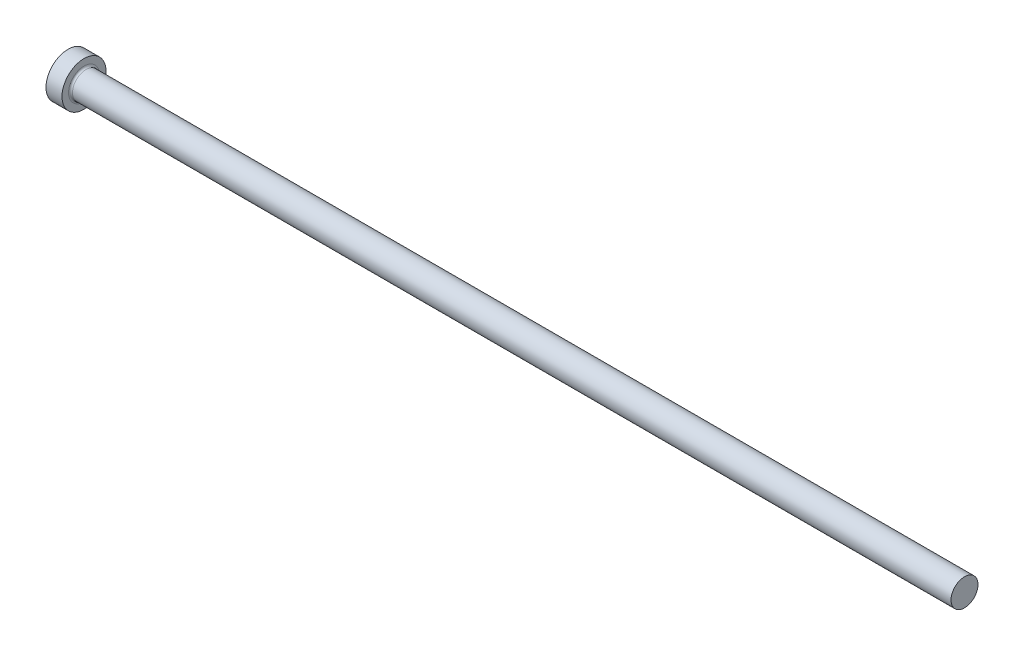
ISO-10303-21;
HEADER;
FILE_DESCRIPTION(('STEP AP214'),'2;1');
FILE_NAME('part.step','',(''),(''),'','','');
FILE_SCHEMA(('AUTOMOTIVE_DESIGN { 1 0 10303 214 1 1 1 1 }'));
ENDSEC;
DATA;
#1=APPLICATION_CONTEXT('core data for automotive mechanical design processes');
#2=APPLICATION_PROTOCOL_DEFINITION('international standard','automotive_design',2000,#1);
#3=PRODUCT_CONTEXT('',#1,'mechanical');
#4=PRODUCT('Part','Part','',(#3));
#5=PRODUCT_RELATED_PRODUCT_CATEGORY('part','',(#4));
#6=PRODUCT_DEFINITION_FORMATION('','',#4);
#7=PRODUCT_DEFINITION_CONTEXT('part definition',#1,'design');
#8=PRODUCT_DEFINITION('design','',#6,#7);
#9=PRODUCT_DEFINITION_SHAPE('','',#8);
#10=(LENGTH_UNIT() NAMED_UNIT(*) SI_UNIT(.MILLI.,.METRE.));
#11=(NAMED_UNIT(*) PLANE_ANGLE_UNIT() SI_UNIT($,.RADIAN.));
#12=(NAMED_UNIT(*) SI_UNIT($,.STERADIAN.) SOLID_ANGLE_UNIT());
#13=UNCERTAINTY_MEASURE_WITH_UNIT(LENGTH_MEASURE(1.E-05),#10,'distance_accuracy_value','');
#14=(GEOMETRIC_REPRESENTATION_CONTEXT(3) GLOBAL_UNCERTAINTY_ASSIGNED_CONTEXT((#13)) GLOBAL_UNIT_ASSIGNED_CONTEXT((#10,
#11,#12)) REPRESENTATION_CONTEXT('',''));
#15=CARTESIAN_POINT('',(0.,0.,0.));
#16=DIRECTION('',(0.,0.,1.));
#17=DIRECTION('',(1.,0.,0.));
#18=AXIS2_PLACEMENT_3D('',#15,#16,#17);
#19=CARTESIAN_POINT('',(0.,0.,0.));
#20=DIRECTION('',(1.,0.,0.));
#21=DIRECTION('',(0.,1.,0.));
#22=AXIS2_PLACEMENT_3D('',#19,#20,#21);
#23=PLANE('',#22);
#24=CARTESIAN_POINT('',(0.,0.,0.));
#25=DIRECTION('',(-1.,0.,0.));
#26=DIRECTION('',(0.,-1.,0.));
#27=AXIS2_PLACEMENT_3D('',#24,#25,#26);
#28=CIRCLE('',#27,8.73124999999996);
#29=CARTESIAN_POINT('',(0.,-8.73124999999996,0.));
#30=VERTEX_POINT('',#29);
#31=EDGE_CURVE('E10',#30,#30,#28,.T.);
#32=ORIENTED_EDGE('',*,*,#31,.T.);
#33=EDGE_LOOP('',(#32));
#34=FACE_BOUND('',#33,.T.);
#35=ADVANCED_FACE('F29',(#34),#23,.F.);
#36=CARTESIAN_POINT('',(355.6,0.,0.));
#37=DIRECTION('',(-1.,0.,0.));
#38=DIRECTION('',(0.,-1.,0.));
#39=AXIS2_PLACEMENT_3D('',#36,#37,#38);
#40=CYLINDRICAL_SURFACE('',#39,8.73124999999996);
#41=ORIENTED_EDGE('',*,*,#31,.F.);
#42=EDGE_LOOP('',(#41));
#43=FACE_BOUND('',#42,.T.);
#44=CARTESIAN_POINT('',(6.35000000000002,0.,0.));
#45=DIRECTION('',(-1.,0.,0.));
#46=DIRECTION('',(0.,-1.,0.));
#47=AXIS2_PLACEMENT_3D('',#44,#45,#46);
#48=CIRCLE('',#47,8.73124999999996);
#49=CARTESIAN_POINT('',(6.35000000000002,-8.73124999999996,0.));
#50=VERTEX_POINT('',#49);
#51=EDGE_CURVE('E35',#50,#50,#48,.T.);
#52=ORIENTED_EDGE('',*,*,#51,.T.);
#53=EDGE_LOOP('',(#52));
#54=FACE_BOUND('',#53,.T.);
#55=ADVANCED_FACE('F64',(#43,#54),#40,.T.);
#56=CARTESIAN_POINT('',(6.35,8.73124999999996,0.));
#57=DIRECTION('',(-1.,0.,0.));
#58=DIRECTION('',(0.,-1.,0.));
#59=AXIS2_PLACEMENT_3D('',#56,#57,#58);
#60=PLANE('',#59);
#61=ORIENTED_EDGE('',*,*,#51,.F.);
#62=EDGE_LOOP('',(#61));
#63=FACE_BOUND('',#62,.T.);
#64=CARTESIAN_POINT('',(6.35000000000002,0.,0.));
#65=DIRECTION('',(-1.,0.,0.));
#66=DIRECTION('',(0.,-1.,0.));
#67=AXIS2_PLACEMENT_3D('',#64,#65,#66);
#68=CIRCLE('',#67,6.13918);
#69=CARTESIAN_POINT('',(6.35000000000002,-6.13918,0.));
#70=VERTEX_POINT('',#69);
#71=EDGE_CURVE('E39',#70,#70,#68,.T.);
#72=ORIENTED_EDGE('',*,*,#71,.T.);
#73=EDGE_LOOP('',(#72));
#74=FACE_BOUND('',#73,.T.);
#75=ADVANCED_FACE('F68',(#63,#74),#60,.F.);
#76=CARTESIAN_POINT('',(7.1374,0.,0.));
#77=DIRECTION('',(-1.,0.,0.));
#78=DIRECTION('',(0.,-1.,0.));
#79=AXIS2_PLACEMENT_3D('',#76,#77,#78);
#80=TOROIDAL_SURFACE('',#79,6.13918,0.787399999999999);
#81=ORIENTED_EDGE('',*,*,#71,.F.);
#82=EDGE_LOOP('',(#81));
#83=FACE_BOUND('',#82,.T.);
#84=CARTESIAN_POINT('',(7.13740000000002,0.,0.));
#85=DIRECTION('',(-1.,0.,0.));
#86=DIRECTION('',(0.,-1.,0.));
#87=AXIS2_PLACEMENT_3D('',#84,#85,#86);
#88=CIRCLE('',#87,5.35178);
#89=CARTESIAN_POINT('',(7.13740000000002,-5.35178,0.));
#90=VERTEX_POINT('',#89);
#91=EDGE_CURVE('E43',#90,#90,#88,.T.);
#92=ORIENTED_EDGE('',*,*,#91,.T.);
#93=EDGE_LOOP('',(#92));
#94=FACE_BOUND('',#93,.T.);
#95=ADVANCED_FACE('F60',(#83,#94),#80,.F.);
#96=CARTESIAN_POINT('',(355.6,0.,0.));
#97=DIRECTION('',(-1.,0.,0.));
#98=DIRECTION('',(0.,-1.,0.));
#99=AXIS2_PLACEMENT_3D('',#96,#97,#98);
#100=CYLINDRICAL_SURFACE('',#99,5.35177999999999);
#101=ORIENTED_EDGE('',*,*,#91,.F.);
#102=EDGE_LOOP('',(#101));
#103=FACE_BOUND('',#102,.T.);
#104=CARTESIAN_POINT('',(355.6,0.,0.));
#105=DIRECTION('',(-1.,0.,0.));
#106=DIRECTION('',(0.,-1.,0.));
#107=AXIS2_PLACEMENT_3D('',#104,#105,#106);
#108=CIRCLE('',#107,5.35177999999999);
#109=CARTESIAN_POINT('',(355.6,-5.35177999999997,0.));
#110=VERTEX_POINT('',#109);
#111=EDGE_CURVE('E48',#110,#110,#108,.T.);
#112=ORIENTED_EDGE('',*,*,#111,.T.);
#113=EDGE_LOOP('',(#112));
#114=FACE_BOUND('',#113,.T.);
#115=ADVANCED_FACE('F52',(#103,#114),#100,.T.);
#116=CARTESIAN_POINT('',(355.6,5.35178,0.));
#117=DIRECTION('',(-1.,0.,0.));
#118=DIRECTION('',(0.,-1.,0.));
#119=AXIS2_PLACEMENT_3D('',#116,#117,#118);
#120=PLANE('',#119);
#121=ORIENTED_EDGE('',*,*,#111,.F.);
#122=EDGE_LOOP('',(#121));
#123=FACE_BOUND('',#122,.T.);
#124=ADVANCED_FACE('F54',(#123),#120,.F.);
#125=CLOSED_SHELL('',(#35,#55,#75,#95,#115,#124));
#126=MANIFOLD_SOLID_BREP('B2',#125);
#127=ADVANCED_BREP_SHAPE_REPRESENTATION('',(#18,#126),#14);
#128=SHAPE_DEFINITION_REPRESENTATION(#9,#127);
ENDSEC;
END-ISO-10303-21;
